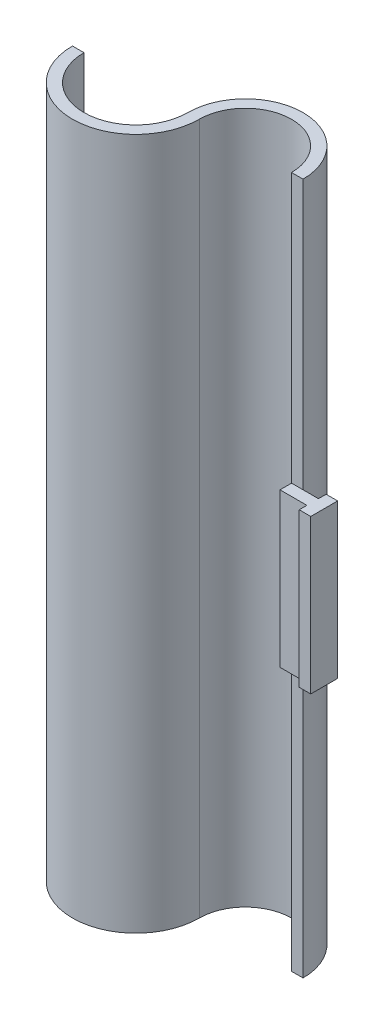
ISO-10303-21;
HEADER;
FILE_DESCRIPTION(('STEP AP214'),'2;1');
FILE_NAME('part.step','',(''),(''),'','','');
FILE_SCHEMA(('AUTOMOTIVE_DESIGN { 1 0 10303 214 1 1 1 1 }'));
ENDSEC;
DATA;
#1=APPLICATION_CONTEXT('core data for automotive mechanical design processes');
#2=APPLICATION_PROTOCOL_DEFINITION('international standard','automotive_design',2000,#1);
#3=PRODUCT_CONTEXT('',#1,'mechanical');
#4=PRODUCT('Part','Part','',(#3));
#5=PRODUCT_RELATED_PRODUCT_CATEGORY('part','',(#4));
#6=PRODUCT_DEFINITION_FORMATION('','',#4);
#7=PRODUCT_DEFINITION_CONTEXT('part definition',#1,'design');
#8=PRODUCT_DEFINITION('design','',#6,#7);
#9=PRODUCT_DEFINITION_SHAPE('','',#8);
#10=(LENGTH_UNIT() NAMED_UNIT(*) SI_UNIT(.MILLI.,.METRE.));
#11=(NAMED_UNIT(*) PLANE_ANGLE_UNIT() SI_UNIT($,.RADIAN.));
#12=(NAMED_UNIT(*) SI_UNIT($,.STERADIAN.) SOLID_ANGLE_UNIT());
#13=UNCERTAINTY_MEASURE_WITH_UNIT(LENGTH_MEASURE(1.E-05),#10,'distance_accuracy_value','');
#14=(GEOMETRIC_REPRESENTATION_CONTEXT(3) GLOBAL_UNCERTAINTY_ASSIGNED_CONTEXT((#13)) GLOBAL_UNIT_ASSIGNED_CONTEXT((#10,
#11,#12)) REPRESENTATION_CONTEXT('',''));
#15=CARTESIAN_POINT('',(0.,0.,0.));
#16=DIRECTION('',(0.,0.,1.));
#17=DIRECTION('',(1.,0.,0.));
#18=AXIS2_PLACEMENT_3D('',#15,#16,#17);
#19=CARTESIAN_POINT('',(-3.,180.,0.));
#20=DIRECTION('',(0.,0.,-1.));
#21=DIRECTION('',(-1.,0.,0.));
#22=AXIS2_PLACEMENT_3D('',#19,#20,#21);
#23=PLANE('',#22);
#24=DIRECTION('',(-1.,0.,0.));
#25=VECTOR('',#24,1.);
#26=CARTESIAN_POINT('',(-3.,110.,0.));
#27=LINE('',#26,#25);
#28=CARTESIAN_POINT('',(0.,110.,0.));
#29=VERTEX_POINT('',#28);
#30=CARTESIAN_POINT('',(-3.,110.,0.));
#31=VERTEX_POINT('',#30);
#32=EDGE_CURVE('E11',#29,#31,#27,.T.);
#33=ORIENTED_EDGE('',*,*,#32,.F.);
#34=DIRECTION('',(0.,-1.,0.));
#35=VECTOR('',#34,1.);
#36=CARTESIAN_POINT('',(0.,180.,0.));
#37=LINE('',#36,#35);
#38=CARTESIAN_POINT('',(0.,180.,0.));
#39=VERTEX_POINT('',#38);
#40=EDGE_CURVE('E146',#39,#29,#37,.T.);
#41=ORIENTED_EDGE('',*,*,#40,.F.);
#42=DIRECTION('',(1.,0.,0.));
#43=VECTOR('',#42,1.);
#44=CARTESIAN_POINT('',(-3.,180.,0.));
#45=LINE('',#44,#43);
#46=CARTESIAN_POINT('',(-3.,180.,0.));
#47=VERTEX_POINT('',#46);
#48=EDGE_CURVE('E57',#47,#39,#45,.T.);
#49=ORIENTED_EDGE('',*,*,#48,.F.);
#50=DIRECTION('',(0.,-1.,0.));
#51=VECTOR('',#50,1.);
#52=CARTESIAN_POINT('',(-3.,180.,0.));
#53=LINE('',#52,#51);
#54=EDGE_CURVE('E124',#47,#31,#53,.T.);
#55=ORIENTED_EDGE('',*,*,#54,.T.);
#56=EDGE_LOOP('',(#33,#41,#49,#55));
#57=FACE_BOUND('',#56,.T.);
#58=ADVANCED_FACE('F33',(#57),#23,.F.);
#59=CARTESIAN_POINT('',(-15.,180.,0.));
#60=DIRECTION('',(0.,-1.,0.));
#61=DIRECTION('',(0.,0.,-1.));
#62=AXIS2_PLACEMENT_3D('',#59,#60,#61);
#63=CYLINDRICAL_SURFACE('',#62,15.);
#64=CARTESIAN_POINT('',(-15.,0.,0.));
#65=DIRECTION('',(0.,1.,0.));
#66=DIRECTION('',(0.,0.,1.));
#67=AXIS2_PLACEMENT_3D('',#64,#65,#66);
#68=CIRCLE('',#67,15.);
#69=CARTESIAN_POINT('',(0.,0.,0.));
#70=VERTEX_POINT('',#69);
#71=CARTESIAN_POINT('',(-30.,0.,0.));
#72=VERTEX_POINT('',#71);
#73=EDGE_CURVE('E133',#70,#72,#68,.T.);
#74=ORIENTED_EDGE('',*,*,#73,.T.);
#75=DIRECTION('',(0.,-1.,0.));
#76=VECTOR('',#75,1.);
#77=CARTESIAN_POINT('',(-30.,180.,0.));
#78=LINE('',#77,#76);
#79=CARTESIAN_POINT('',(-30.,180.,0.));
#80=VERTEX_POINT('',#79);
#81=EDGE_CURVE('E156',#80,#72,#78,.T.);
#82=ORIENTED_EDGE('',*,*,#81,.F.);
#83=CARTESIAN_POINT('',(-15.,180.,0.));
#84=DIRECTION('',(0.,1.,0.));
#85=DIRECTION('',(0.,0.,1.));
#86=AXIS2_PLACEMENT_3D('',#83,#84,#85);
#87=CIRCLE('',#86,15.);
#88=EDGE_CURVE('E145',#39,#80,#87,.T.);
#89=ORIENTED_EDGE('',*,*,#88,.F.);
#90=ORIENTED_EDGE('',*,*,#40,.T.);
#91=CARTESIAN_POINT('',(0.,70.,0.));
#92=VERTEX_POINT('',#91);
#93=EDGE_CURVE('E150',#29,#92,#37,.T.);
#94=ORIENTED_EDGE('',*,*,#93,.T.);
#95=EDGE_CURVE('E85',#92,#70,#37,.T.);
#96=ORIENTED_EDGE('',*,*,#95,.T.);
#97=EDGE_LOOP('',(#74,#82,#89,#90,#94,#96));
#98=FACE_BOUND('',#97,.T.);
#99=ADVANCED_FACE('F35',(#98),#63,.T.);
#100=CARTESIAN_POINT('',(-43.5,180.,0.));
#101=DIRECTION('',(0.,-1.,0.));
#102=DIRECTION('',(0.,0.,-1.));
#103=AXIS2_PLACEMENT_3D('',#100,#101,#102);
#104=CYLINDRICAL_SURFACE('',#103,13.5);
#105=CARTESIAN_POINT('',(-43.5,0.,0.));
#106=DIRECTION('',(0.,-1.,0.));
#107=DIRECTION('',(0.,0.,-1.));
#108=AXIS2_PLACEMENT_3D('',#105,#106,#107);
#109=CIRCLE('',#108,13.5);
#110=CARTESIAN_POINT('',(-57.,0.,0.));
#111=VERTEX_POINT('',#110);
#112=EDGE_CURVE('E135',#72,#111,#109,.T.);
#113=ORIENTED_EDGE('',*,*,#112,.T.);
#114=DIRECTION('',(0.,-1.,0.));
#115=VECTOR('',#114,1.);
#116=CARTESIAN_POINT('',(-57.,180.,0.));
#117=LINE('',#116,#115);
#118=CARTESIAN_POINT('',(-57.,180.,0.));
#119=VERTEX_POINT('',#118);
#120=EDGE_CURVE('E153',#119,#111,#117,.T.);
#121=ORIENTED_EDGE('',*,*,#120,.F.);
#122=CARTESIAN_POINT('',(-43.5,180.,0.));
#123=DIRECTION('',(0.,-1.,0.));
#124=DIRECTION('',(0.,0.,-1.));
#125=AXIS2_PLACEMENT_3D('',#122,#123,#124);
#126=CIRCLE('',#125,13.5);
#127=EDGE_CURVE('E94',#80,#119,#126,.T.);
#128=ORIENTED_EDGE('',*,*,#127,.F.);
#129=ORIENTED_EDGE('',*,*,#81,.T.);
#130=EDGE_LOOP('',(#113,#121,#128,#129));
#131=FACE_BOUND('',#130,.T.);
#132=ADVANCED_FACE('F173',(#131),#104,.F.);
#133=CARTESIAN_POINT('',(-60.,180.,0.));
#134=DIRECTION('',(0.,0.,1.));
#135=DIRECTION('',(1.,0.,0.));
#136=AXIS2_PLACEMENT_3D('',#133,#134,#135);
#137=PLANE('',#136);
#138=DIRECTION('',(-1.,0.,0.));
#139=VECTOR('',#138,1.);
#140=CARTESIAN_POINT('',(-60.,0.,0.));
#141=LINE('',#140,#139);
#142=CARTESIAN_POINT('',(-60.,0.,0.));
#143=VERTEX_POINT('',#142);
#144=EDGE_CURVE('E138',#111,#143,#141,.T.);
#145=ORIENTED_EDGE('',*,*,#144,.T.);
#146=DIRECTION('',(0.,-1.,0.));
#147=VECTOR('',#146,1.);
#148=CARTESIAN_POINT('',(-60.,180.,0.));
#149=LINE('',#148,#147);
#150=CARTESIAN_POINT('',(-60.,180.,0.));
#151=VERTEX_POINT('',#150);
#152=EDGE_CURVE('E123',#151,#143,#149,.T.);
#153=ORIENTED_EDGE('',*,*,#152,.F.);
#154=DIRECTION('',(-1.,0.,0.));
#155=VECTOR('',#154,1.);
#156=CARTESIAN_POINT('',(-60.,180.,0.));
#157=LINE('',#156,#155);
#158=EDGE_CURVE('E110',#119,#151,#157,.T.);
#159=ORIENTED_EDGE('',*,*,#158,.F.);
#160=ORIENTED_EDGE('',*,*,#120,.T.);
#161=EDGE_LOOP('',(#145,#153,#159,#160));
#162=FACE_BOUND('',#161,.T.);
#163=ADVANCED_FACE('F175',(#162),#137,.F.);
#164=CARTESIAN_POINT('',(-43.5,180.,0.));
#165=DIRECTION('',(0.,-1.,0.));
#166=DIRECTION('',(0.,0.,-1.));
#167=AXIS2_PLACEMENT_3D('',#164,#165,#166);
#168=CYLINDRICAL_SURFACE('',#167,16.5);
#169=CARTESIAN_POINT('',(-43.5,0.,0.));
#170=DIRECTION('',(0.,1.,0.));
#171=DIRECTION('',(0.,0.,-1.));
#172=AXIS2_PLACEMENT_3D('',#169,#170,#171);
#173=CIRCLE('',#172,16.5);
#174=CARTESIAN_POINT('',(-27.,0.,0.));
#175=VERTEX_POINT('',#174);
#176=EDGE_CURVE('E119',#143,#175,#173,.T.);
#177=ORIENTED_EDGE('',*,*,#176,.T.);
#178=DIRECTION('',(0.,-1.,0.));
#179=VECTOR('',#178,1.);
#180=CARTESIAN_POINT('',(-27.,180.,0.));
#181=LINE('',#180,#179);
#182=CARTESIAN_POINT('',(-27.,180.,0.));
#183=VERTEX_POINT('',#182);
#184=EDGE_CURVE('E116',#183,#175,#181,.T.);
#185=ORIENTED_EDGE('',*,*,#184,.F.);
#186=CARTESIAN_POINT('',(-43.5,180.,0.));
#187=DIRECTION('',(0.,1.,0.));
#188=DIRECTION('',(0.,0.,-1.));
#189=AXIS2_PLACEMENT_3D('',#186,#187,#188);
#190=CIRCLE('',#189,16.5);
#191=EDGE_CURVE('E103',#151,#183,#190,.T.);
#192=ORIENTED_EDGE('',*,*,#191,.F.);
#193=ORIENTED_EDGE('',*,*,#152,.T.);
#194=EDGE_LOOP('',(#177,#185,#192,#193));
#195=FACE_BOUND('',#194,.T.);
#196=ADVANCED_FACE('F117',(#195),#168,.T.);
#197=CARTESIAN_POINT('',(-15.,180.,0.));
#198=DIRECTION('',(0.,-1.,0.));
#199=DIRECTION('',(0.,0.,-1.));
#200=AXIS2_PLACEMENT_3D('',#197,#198,#199);
#201=CYLINDRICAL_SURFACE('',#200,12.);
#202=CARTESIAN_POINT('',(-15.,0.,0.));
#203=DIRECTION('',(0.,-1.,0.));
#204=DIRECTION('',(0.,0.,1.));
#205=AXIS2_PLACEMENT_3D('',#202,#203,#204);
#206=CIRCLE('',#205,12.);
#207=CARTESIAN_POINT('',(-3.,0.,0.));
#208=VERTEX_POINT('',#207);
#209=EDGE_CURVE('E141',#175,#208,#206,.T.);
#210=ORIENTED_EDGE('',*,*,#209,.T.);
#211=CARTESIAN_POINT('',(-3.,70.,0.));
#212=VERTEX_POINT('',#211);
#213=EDGE_CURVE('E149',#212,#208,#53,.T.);
#214=ORIENTED_EDGE('',*,*,#213,.F.);
#215=DIRECTION('',(0.,-1.,0.));
#216=VECTOR('',#215,1.);
#217=CARTESIAN_POINT('',(-3.,110.,0.));
#218=LINE('',#217,#216);
#219=EDGE_CURVE('E165',#31,#212,#218,.T.);
#220=ORIENTED_EDGE('',*,*,#219,.F.);
#221=ORIENTED_EDGE('',*,*,#54,.F.);
#222=CARTESIAN_POINT('',(-15.,180.,0.));
#223=DIRECTION('',(0.,-1.,0.));
#224=DIRECTION('',(0.,0.,1.));
#225=AXIS2_PLACEMENT_3D('',#222,#223,#224);
#226=CIRCLE('',#225,12.);
#227=EDGE_CURVE('E107',#183,#47,#226,.T.);
#228=ORIENTED_EDGE('',*,*,#227,.F.);
#229=ORIENTED_EDGE('',*,*,#184,.T.);
#230=EDGE_LOOP('',(#210,#214,#220,#221,#228,#229));
#231=FACE_BOUND('',#230,.T.);
#232=ADVANCED_FACE('F126',(#231),#201,.F.);
#233=ORIENTED_EDGE('',*,*,#95,.F.);
#234=DIRECTION('',(-1.,0.,0.));
#235=VECTOR('',#234,1.);
#236=CARTESIAN_POINT('',(-3.,70.,0.));
#237=LINE('',#236,#235);
#238=EDGE_CURVE('E41',#92,#212,#237,.T.);
#239=ORIENTED_EDGE('',*,*,#238,.T.);
#240=ORIENTED_EDGE('',*,*,#213,.T.);
#241=DIRECTION('',(1.,0.,0.));
#242=VECTOR('',#241,1.);
#243=CARTESIAN_POINT('',(-3.,0.,0.));
#244=LINE('',#243,#242);
#245=EDGE_CURVE('E143',#208,#70,#244,.T.);
#246=ORIENTED_EDGE('',*,*,#245,.T.);
#247=EDGE_LOOP('',(#233,#239,#240,#246));
#248=FACE_BOUND('',#247,.T.);
#249=ADVANCED_FACE('F160',(#248),#23,.F.);
#250=CARTESIAN_POINT('',(-15.,180.,0.));
#251=DIRECTION('',(0.,1.,0.));
#252=DIRECTION('',(0.,0.,1.));
#253=AXIS2_PLACEMENT_3D('',#250,#251,#252);
#254=PLANE('',#253);
#255=ORIENTED_EDGE('',*,*,#88,.T.);
#256=ORIENTED_EDGE('',*,*,#127,.T.);
#257=ORIENTED_EDGE('',*,*,#158,.T.);
#258=ORIENTED_EDGE('',*,*,#191,.T.);
#259=ORIENTED_EDGE('',*,*,#227,.T.);
#260=ORIENTED_EDGE('',*,*,#48,.T.);
#261=EDGE_LOOP('',(#255,#256,#257,#258,#259,#260));
#262=FACE_BOUND('',#261,.T.);
#263=ADVANCED_FACE('F105',(#262),#254,.T.);
#264=CARTESIAN_POINT('',(-15.,0.,0.));
#265=DIRECTION('',(0.,1.,0.));
#266=DIRECTION('',(0.,0.,1.));
#267=AXIS2_PLACEMENT_3D('',#264,#265,#266);
#268=PLANE('',#267);
#269=ORIENTED_EDGE('',*,*,#73,.F.);
#270=ORIENTED_EDGE('',*,*,#245,.F.);
#271=ORIENTED_EDGE('',*,*,#209,.F.);
#272=ORIENTED_EDGE('',*,*,#176,.F.);
#273=ORIENTED_EDGE('',*,*,#144,.F.);
#274=ORIENTED_EDGE('',*,*,#112,.F.);
#275=EDGE_LOOP('',(#269,#270,#271,#272,#273,#274));
#276=FACE_BOUND('',#275,.T.);
#277=ADVANCED_FACE('F169',(#276),#268,.F.);
#278=CARTESIAN_POINT('',(-3.,110.,0.));
#279=DIRECTION('',(0.,0.,1.));
#280=DIRECTION('',(1.,0.,0.));
#281=AXIS2_PLACEMENT_3D('',#278,#279,#280);
#282=PLANE('',#281);
#283=DIRECTION('',(-1.,0.,0.));
#284=VECTOR('',#283,1.);
#285=CARTESIAN_POINT('',(-3.,70.,0.));
#286=LINE('',#285,#284);
#287=CARTESIAN_POINT('',(4.,70.,0.));
#288=VERTEX_POINT('',#287);
#289=EDGE_CURVE('E215',#288,#92,#286,.T.);
#290=ORIENTED_EDGE('',*,*,#289,.T.);
#291=ORIENTED_EDGE('',*,*,#93,.F.);
#292=DIRECTION('',(-1.,0.,0.));
#293=VECTOR('',#292,1.);
#294=CARTESIAN_POINT('',(-3.,110.,0.));
#295=LINE('',#294,#293);
#296=CARTESIAN_POINT('',(4.,110.,0.));
#297=VERTEX_POINT('',#296);
#298=EDGE_CURVE('E237',#297,#29,#295,.T.);
#299=ORIENTED_EDGE('',*,*,#298,.F.);
#300=DIRECTION('',(0.,-1.,0.));
#301=VECTOR('',#300,1.);
#302=CARTESIAN_POINT('',(4.,110.,0.));
#303=LINE('',#302,#301);
#304=EDGE_CURVE('E181',#297,#288,#303,.T.);
#305=ORIENTED_EDGE('',*,*,#304,.T.);
#306=EDGE_LOOP('',(#290,#291,#299,#305));
#307=FACE_BOUND('',#306,.T.);
#308=ADVANCED_FACE('F368',(#307),#282,.F.);
#309=CARTESIAN_POINT('',(4.,110.,-2.));
#310=DIRECTION('',(0.,0.,1.));
#311=DIRECTION('',(1.,0.,0.));
#312=AXIS2_PLACEMENT_3D('',#309,#310,#311);
#313=PLANE('',#312);
#314=DIRECTION('',(-1.,0.,0.));
#315=VECTOR('',#314,1.);
#316=CARTESIAN_POINT('',(4.,70.,-2.));
#317=LINE('',#316,#315);
#318=CARTESIAN_POINT('',(7.,70.,-2.));
#319=VERTEX_POINT('',#318);
#320=CARTESIAN_POINT('',(4.,70.,-2.));
#321=VERTEX_POINT('',#320);
#322=EDGE_CURVE('E220',#319,#321,#317,.T.);
#323=ORIENTED_EDGE('',*,*,#322,.T.);
#324=DIRECTION('',(0.,-1.,0.));
#325=VECTOR('',#324,1.);
#326=CARTESIAN_POINT('',(4.,110.,-2.));
#327=LINE('',#326,#325);
#328=CARTESIAN_POINT('',(4.,110.,-2.));
#329=VERTEX_POINT('',#328);
#330=EDGE_CURVE('E136',#329,#321,#327,.T.);
#331=ORIENTED_EDGE('',*,*,#330,.F.);
#332=DIRECTION('',(-1.,0.,0.));
#333=VECTOR('',#332,1.);
#334=CARTESIAN_POINT('',(4.,110.,-2.));
#335=LINE('',#334,#333);
#336=CARTESIAN_POINT('',(7.,110.,-2.));
#337=VERTEX_POINT('',#336);
#338=EDGE_CURVE('E204',#337,#329,#335,.T.);
#339=ORIENTED_EDGE('',*,*,#338,.F.);
#340=DIRECTION('',(0.,-1.,0.));
#341=VECTOR('',#340,1.);
#342=CARTESIAN_POINT('',(7.,110.,-2.));
#343=LINE('',#342,#341);
#344=EDGE_CURVE('E197',#337,#319,#343,.T.);
#345=ORIENTED_EDGE('',*,*,#344,.T.);
#346=EDGE_LOOP('',(#323,#331,#339,#345));
#347=FACE_BOUND('',#346,.T.);
#348=ADVANCED_FACE('F258',(#347),#313,.F.);
#349=CARTESIAN_POINT('',(4.,110.,-2.));
#350=DIRECTION('',(1.,0.,0.));
#351=DIRECTION('',(0.,0.,-1.));
#352=AXIS2_PLACEMENT_3D('',#349,#350,#351);
#353=PLANE('',#352);
#354=DIRECTION('',(0.,0.,1.));
#355=VECTOR('',#354,1.);
#356=CARTESIAN_POINT('',(4.,70.,-2.));
#357=LINE('',#356,#355);
#358=EDGE_CURVE('E217',#321,#288,#357,.T.);
#359=ORIENTED_EDGE('',*,*,#358,.T.);
#360=ORIENTED_EDGE('',*,*,#304,.F.);
#361=DIRECTION('',(0.,0.,1.));
#362=VECTOR('',#361,1.);
#363=CARTESIAN_POINT('',(4.,110.,-2.));
#364=LINE('',#363,#362);
#365=EDGE_CURVE('E240',#329,#297,#364,.T.);
#366=ORIENTED_EDGE('',*,*,#365,.F.);
#367=ORIENTED_EDGE('',*,*,#330,.T.);
#368=EDGE_LOOP('',(#359,#360,#366,#367));
#369=FACE_BOUND('',#368,.T.);
#370=ADVANCED_FACE('F262',(#369),#353,.F.);
#371=CARTESIAN_POINT('',(-3.,110.,0.));
#372=DIRECTION('',(1.,0.,0.));
#373=DIRECTION('',(0.,0.,-1.));
#374=AXIS2_PLACEMENT_3D('',#371,#372,#373);
#375=PLANE('',#374);
#376=DIRECTION('',(0.,0.,1.));
#377=VECTOR('',#376,1.);
#378=CARTESIAN_POINT('',(-3.,70.,0.));
#379=LINE('',#378,#377);
#380=CARTESIAN_POINT('',(-3.,70.,3.));
#381=VERTEX_POINT('',#380);
#382=EDGE_CURVE('E48',#212,#381,#379,.T.);
#383=ORIENTED_EDGE('',*,*,#382,.T.);
#384=DIRECTION('',(0.,-1.,0.));
#385=VECTOR('',#384,1.);
#386=CARTESIAN_POINT('',(-3.,110.,3.));
#387=LINE('',#386,#385);
#388=CARTESIAN_POINT('',(-3.,110.,3.));
#389=VERTEX_POINT('',#388);
#390=EDGE_CURVE('E185',#389,#381,#387,.T.);
#391=ORIENTED_EDGE('',*,*,#390,.F.);
#392=DIRECTION('',(0.,0.,1.));
#393=VECTOR('',#392,1.);
#394=CARTESIAN_POINT('',(-3.,110.,0.));
#395=LINE('',#394,#393);
#396=EDGE_CURVE('E234',#31,#389,#395,.T.);
#397=ORIENTED_EDGE('',*,*,#396,.F.);
#398=ORIENTED_EDGE('',*,*,#219,.T.);
#399=EDGE_LOOP('',(#383,#391,#397,#398));
#400=FACE_BOUND('',#399,.T.);
#401=ADVANCED_FACE('F296',(#400),#375,.F.);
#402=CARTESIAN_POINT('',(-3.,110.,3.));
#403=DIRECTION('',(0.,0.,-1.));
#404=DIRECTION('',(-1.,0.,0.));
#405=AXIS2_PLACEMENT_3D('',#402,#403,#404);
#406=PLANE('',#405);
#407=DIRECTION('',(1.,0.,0.));
#408=VECTOR('',#407,1.);
#409=CARTESIAN_POINT('',(-3.,70.,3.));
#410=LINE('',#409,#408);
#411=CARTESIAN_POINT('',(4.,70.,3.));
#412=VERTEX_POINT('',#411);
#413=EDGE_CURVE('E211',#381,#412,#410,.T.);
#414=ORIENTED_EDGE('',*,*,#413,.T.);
#415=DIRECTION('',(0.,-1.,0.));
#416=VECTOR('',#415,1.);
#417=CARTESIAN_POINT('',(4.,110.,3.));
#418=LINE('',#417,#416);
#419=CARTESIAN_POINT('',(4.,110.,3.));
#420=VERTEX_POINT('',#419);
#421=EDGE_CURVE('E188',#420,#412,#418,.T.);
#422=ORIENTED_EDGE('',*,*,#421,.F.);
#423=DIRECTION('',(1.,0.,0.));
#424=VECTOR('',#423,1.);
#425=CARTESIAN_POINT('',(-3.,110.,3.));
#426=LINE('',#425,#424);
#427=EDGE_CURVE('E231',#389,#420,#426,.T.);
#428=ORIENTED_EDGE('',*,*,#427,.F.);
#429=ORIENTED_EDGE('',*,*,#390,.T.);
#430=EDGE_LOOP('',(#414,#422,#428,#429));
#431=FACE_BOUND('',#430,.T.);
#432=ADVANCED_FACE('F300',(#431),#406,.F.);
#433=CARTESIAN_POINT('',(4.,110.,3.));
#434=DIRECTION('',(1.,0.,0.));
#435=DIRECTION('',(0.,0.,-1.));
#436=AXIS2_PLACEMENT_3D('',#433,#434,#435);
#437=PLANE('',#436);
#438=DIRECTION('',(0.,0.,1.));
#439=VECTOR('',#438,1.);
#440=CARTESIAN_POINT('',(4.,70.,3.));
#441=LINE('',#440,#439);
#442=CARTESIAN_POINT('',(4.,70.,5.));
#443=VERTEX_POINT('',#442);
#444=EDGE_CURVE('E208',#412,#443,#441,.T.);
#445=ORIENTED_EDGE('',*,*,#444,.T.);
#446=DIRECTION('',(0.,-1.,0.));
#447=VECTOR('',#446,1.);
#448=CARTESIAN_POINT('',(4.,110.,5.));
#449=LINE('',#448,#447);
#450=CARTESIAN_POINT('',(4.,110.,5.));
#451=VERTEX_POINT('',#450);
#452=EDGE_CURVE('E191',#451,#443,#449,.T.);
#453=ORIENTED_EDGE('',*,*,#452,.F.);
#454=DIRECTION('',(0.,0.,1.));
#455=VECTOR('',#454,1.);
#456=CARTESIAN_POINT('',(4.,110.,3.));
#457=LINE('',#456,#455);
#458=EDGE_CURVE('E228',#420,#451,#457,.T.);
#459=ORIENTED_EDGE('',*,*,#458,.F.);
#460=ORIENTED_EDGE('',*,*,#421,.T.);
#461=EDGE_LOOP('',(#445,#453,#459,#460));
#462=FACE_BOUND('',#461,.T.);
#463=ADVANCED_FACE('F304',(#462),#437,.F.);
#464=CARTESIAN_POINT('',(4.,110.,5.));
#465=DIRECTION('',(0.,0.,-1.));
#466=DIRECTION('',(-1.,0.,0.));
#467=AXIS2_PLACEMENT_3D('',#464,#465,#466);
#468=PLANE('',#467);
#469=DIRECTION('',(1.,0.,0.));
#470=VECTOR('',#469,1.);
#471=CARTESIAN_POINT('',(4.,70.,5.));
#472=LINE('',#471,#470);
#473=CARTESIAN_POINT('',(7.,70.,5.));
#474=VERTEX_POINT('',#473);
#475=EDGE_CURVE('E205',#443,#474,#472,.T.);
#476=ORIENTED_EDGE('',*,*,#475,.T.);
#477=DIRECTION('',(0.,-1.,0.));
#478=VECTOR('',#477,1.);
#479=CARTESIAN_POINT('',(7.,110.,5.));
#480=LINE('',#479,#478);
#481=CARTESIAN_POINT('',(7.,110.,5.));
#482=VERTEX_POINT('',#481);
#483=EDGE_CURVE('E194',#482,#474,#480,.T.);
#484=ORIENTED_EDGE('',*,*,#483,.F.);
#485=DIRECTION('',(1.,0.,0.));
#486=VECTOR('',#485,1.);
#487=CARTESIAN_POINT('',(4.,110.,5.));
#488=LINE('',#487,#486);
#489=EDGE_CURVE('E225',#451,#482,#488,.T.);
#490=ORIENTED_EDGE('',*,*,#489,.F.);
#491=ORIENTED_EDGE('',*,*,#452,.T.);
#492=EDGE_LOOP('',(#476,#484,#490,#491));
#493=FACE_BOUND('',#492,.T.);
#494=ADVANCED_FACE('F308',(#493),#468,.F.);
#495=CARTESIAN_POINT('',(7.,110.,-2.));
#496=DIRECTION('',(-1.,0.,0.));
#497=DIRECTION('',(0.,0.,1.));
#498=AXIS2_PLACEMENT_3D('',#495,#496,#497);
#499=PLANE('',#498);
#500=DIRECTION('',(0.,0.,-1.));
#501=VECTOR('',#500,1.);
#502=CARTESIAN_POINT('',(7.,70.,-2.));
#503=LINE('',#502,#501);
#504=EDGE_CURVE('E201',#474,#319,#503,.T.);
#505=ORIENTED_EDGE('',*,*,#504,.T.);
#506=ORIENTED_EDGE('',*,*,#344,.F.);
#507=DIRECTION('',(0.,0.,-1.));
#508=VECTOR('',#507,1.);
#509=CARTESIAN_POINT('',(7.,110.,-2.));
#510=LINE('',#509,#508);
#511=EDGE_CURVE('E200',#482,#337,#510,.T.);
#512=ORIENTED_EDGE('',*,*,#511,.F.);
#513=ORIENTED_EDGE('',*,*,#483,.T.);
#514=EDGE_LOOP('',(#505,#506,#512,#513));
#515=FACE_BOUND('',#514,.T.);
#516=ADVANCED_FACE('F311',(#515),#499,.F.);
#517=CARTESIAN_POINT('',(0.,110.,0.));
#518=DIRECTION('',(0.,-1.,0.));
#519=DIRECTION('',(0.,0.,-1.));
#520=AXIS2_PLACEMENT_3D('',#517,#518,#519);
#521=PLANE('',#520);
#522=ORIENTED_EDGE('',*,*,#338,.T.);
#523=ORIENTED_EDGE('',*,*,#365,.T.);
#524=ORIENTED_EDGE('',*,*,#298,.T.);
#525=ORIENTED_EDGE('',*,*,#32,.T.);
#526=ORIENTED_EDGE('',*,*,#396,.T.);
#527=ORIENTED_EDGE('',*,*,#427,.T.);
#528=ORIENTED_EDGE('',*,*,#458,.T.);
#529=ORIENTED_EDGE('',*,*,#489,.T.);
#530=ORIENTED_EDGE('',*,*,#511,.T.);
#531=EDGE_LOOP('',(#522,#523,#524,#525,#526,#527,#528,#529,#530));
#532=FACE_BOUND('',#531,.T.);
#533=ADVANCED_FACE('F248',(#532),#521,.F.);
#534=CARTESIAN_POINT('',(0.,70.,0.));
#535=DIRECTION('',(0.,-1.,0.));
#536=DIRECTION('',(0.,0.,-1.));
#537=AXIS2_PLACEMENT_3D('',#534,#535,#536);
#538=PLANE('',#537);
#539=ORIENTED_EDGE('',*,*,#322,.F.);
#540=ORIENTED_EDGE('',*,*,#504,.F.);
#541=ORIENTED_EDGE('',*,*,#475,.F.);
#542=ORIENTED_EDGE('',*,*,#444,.F.);
#543=ORIENTED_EDGE('',*,*,#413,.F.);
#544=ORIENTED_EDGE('',*,*,#382,.F.);
#545=ORIENTED_EDGE('',*,*,#238,.F.);
#546=ORIENTED_EDGE('',*,*,#289,.F.);
#547=ORIENTED_EDGE('',*,*,#358,.F.);
#548=EDGE_LOOP('',(#539,#540,#541,#542,#543,#544,#545,#546,#547));
#549=FACE_BOUND('',#548,.T.);
#550=ADVANCED_FACE('F312',(#549),#538,.T.);
#551=CLOSED_SHELL('',(#58,#99,#132,#163,#196,#232,#249,#263,#277,#308,#348,#370,#401,#432,#463,
#494,#516,#533,#550));
#552=MANIFOLD_SOLID_BREP('B2',#551);
#553=ADVANCED_BREP_SHAPE_REPRESENTATION('',(#18,#552),#14);
#554=SHAPE_DEFINITION_REPRESENTATION(#9,#553);
ENDSEC;
END-ISO-10303-21;
